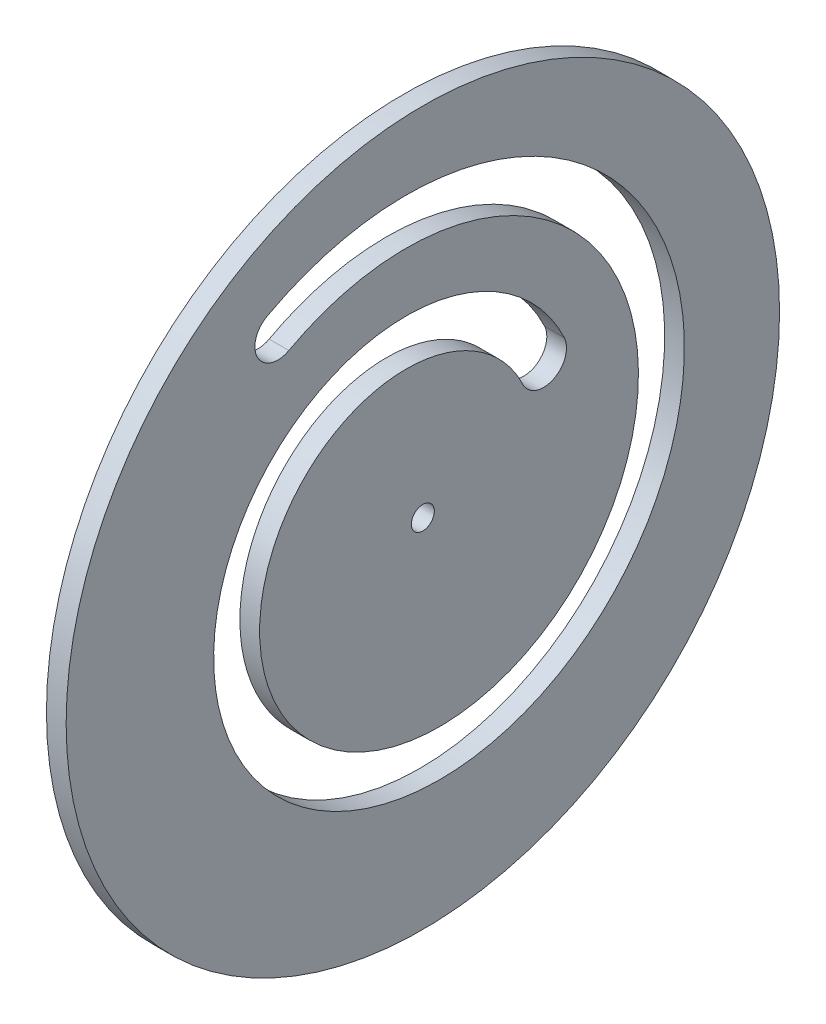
ISO-10303-21;
HEADER;
FILE_DESCRIPTION(('STEP AP214'),'2;1');
FILE_NAME('part.step','',(''),(''),'','','');
FILE_SCHEMA(('AUTOMOTIVE_DESIGN { 1 0 10303 214 1 1 1 1 }'));
ENDSEC;
DATA;
#1=APPLICATION_CONTEXT('core data for automotive mechanical design processes');
#2=APPLICATION_PROTOCOL_DEFINITION('international standard','automotive_design',2000,#1);
#3=PRODUCT_CONTEXT('',#1,'mechanical');
#4=PRODUCT('Part','Part','',(#3));
#5=PRODUCT_RELATED_PRODUCT_CATEGORY('part','',(#4));
#6=PRODUCT_DEFINITION_FORMATION('','',#4);
#7=PRODUCT_DEFINITION_CONTEXT('part definition',#1,'design');
#8=PRODUCT_DEFINITION('design','',#6,#7);
#9=PRODUCT_DEFINITION_SHAPE('','',#8);
#10=(LENGTH_UNIT() NAMED_UNIT(*) SI_UNIT(.MILLI.,.METRE.));
#11=(NAMED_UNIT(*) PLANE_ANGLE_UNIT() SI_UNIT($,.RADIAN.));
#12=(NAMED_UNIT(*) SI_UNIT($,.STERADIAN.) SOLID_ANGLE_UNIT());
#13=UNCERTAINTY_MEASURE_WITH_UNIT(LENGTH_MEASURE(1.E-05),#10,'distance_accuracy_value','');
#14=(GEOMETRIC_REPRESENTATION_CONTEXT(3) GLOBAL_UNCERTAINTY_ASSIGNED_CONTEXT((#13)) GLOBAL_UNIT_ASSIGNED_CONTEXT((#10,
#11,#12)) REPRESENTATION_CONTEXT('',''));
#15=CARTESIAN_POINT('',(0.,0.,0.));
#16=DIRECTION('',(0.,0.,1.));
#17=DIRECTION('',(1.,0.,0.));
#18=AXIS2_PLACEMENT_3D('',#15,#16,#17);
#19=CARTESIAN_POINT('',(3.,0.,0.));
#20=DIRECTION('',(-1.,0.,0.));
#21=DIRECTION('',(0.,0.,1.));
#22=AXIS2_PLACEMENT_3D('',#19,#20,#21);
#23=PLANE('',#22);
#24=CARTESIAN_POINT('',(3.,0.,0.));
#25=DIRECTION('',(1.,0.,0.));
#26=DIRECTION('',(0.,0.,-1.));
#27=AXIS2_PLACEMENT_3D('',#24,#25,#26);
#28=CIRCLE('',#27,1.75);
#29=CARTESIAN_POINT('',(3.,0.,-1.75));
#30=VERTEX_POINT('',#29);
#31=EDGE_CURVE('E235',#30,#30,#28,.T.);
#32=ORIENTED_EDGE('',*,*,#31,.F.);
#33=EDGE_LOOP('',(#32));
#34=FACE_BOUND('',#33,.T.);
#35=CARTESIAN_POINT('',(3.,0.,0.));
#36=DIRECTION('',(-1.,0.,0.));
#37=DIRECTION('',(0.,0.,1.));
#38=AXIS2_PLACEMENT_3D('',#35,#36,#37);
#39=CIRCLE('',#38,54.3426823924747);
#40=CARTESIAN_POINT('',(3.,0.,54.3426823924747));
#41=VERTEX_POINT('',#40);
#42=EDGE_CURVE('E11',#41,#41,#39,.T.);
#43=ORIENTED_EDGE('',*,*,#42,.F.);
#44=EDGE_LOOP('',(#43));
#45=FACE_BOUND('',#44,.T.);
#46=CARTESIAN_POINT('',(3.,32.2695191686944,20.4159245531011));
#47=CARTESIAN_POINT('',(3.,33.7619351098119,17.6676561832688));
#48=CARTESIAN_POINT('',(3.,34.9032776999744,14.7536064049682));
#49=CARTESIAN_POINT('',(3.,36.4320805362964,8.79416437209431));
#50=CARTESIAN_POINT('',(3.,36.8216953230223,5.7407079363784));
#51=CARTESIAN_POINT('',(3.,36.8502960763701,-0.309501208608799));
#52=CARTESIAN_POINT('',(3.,36.4894216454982,-3.31467857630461));
#53=CARTESIAN_POINT('',(3.,35.0657424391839,-9.08993148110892));
#54=CARTESIAN_POINT('',(3.,34.0010149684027,-11.8682233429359));
#55=CARTESIAN_POINT('',(3.,31.2592870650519,-17.0314388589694));
#56=CARTESIAN_POINT('',(3.,29.5784115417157,-19.4238727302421));
#57=CARTESIAN_POINT('',(3.,25.7281946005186,-23.686272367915));
#58=CARTESIAN_POINT('',(3.,23.55325401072,-25.5625854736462));
#59=CARTESIAN_POINT('',(3.,18.8641602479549,-28.6997612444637));
#60=CARTESIAN_POINT('',(3.,16.3430171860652,-29.9654203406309));
#61=CARTESIAN_POINT('',(3.,11.1262190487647,-31.8289212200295));
#62=CARTESIAN_POINT('',(3.,8.42260203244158,-32.4297129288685));
#63=CARTESIAN_POINT('',(3.,3.01037185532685,-32.953567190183));
#64=CARTESIAN_POINT('',(3.,0.293303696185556,-32.8775482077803));
#65=CARTESIAN_POINT('',(3.,-4.98207956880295,-32.0794731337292));
#66=CARTESIAN_POINT('',(3.,-7.54883211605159,-31.3562413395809));
#67=CARTESIAN_POINT('',(3.,-12.3754739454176,-29.3336324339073));
#68=CARTESIAN_POINT('',(3.,-14.6432716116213,-28.0310492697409));
#69=CARTESIAN_POINT('',(3.,-18.7480998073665,-24.952166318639));
#70=CARTESIAN_POINT('',(3.,-20.5920281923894,-23.1708171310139));
#71=CARTESIAN_POINT('',(3.,-23.7561876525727,-19.2618740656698));
#72=CARTESIAN_POINT('',(3.,-25.0818838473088,-17.1276868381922));
#73=CARTESIAN_POINT('',(3.,-27.1522236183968,-12.6567888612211));
#74=CARTESIAN_POINT('',(3.,-27.9005624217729,-10.3123349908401));
#75=CARTESIAN_POINT('',(3.,-28.7966241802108,-5.57137621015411));
#76=CARTESIAN_POINT('',(3.,-28.9460411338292,-3.16644394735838));
#77=CARTESIAN_POINT('',(3.,-28.6622615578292,1.54782721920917));
#78=CARTESIAN_POINT('',(3.,-28.2286467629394,3.86576863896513));
#79=CARTESIAN_POINT('',(3.,-26.8317989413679,8.27029471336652));
#80=CARTESIAN_POINT('',(3.,-25.8660519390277,10.3651350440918));
#81=CARTESIAN_POINT('',(3.,-23.4882527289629,14.2075479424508));
#82=CARTESIAN_POINT('',(3.,-22.0717346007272,15.962525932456));
#83=CARTESIAN_POINT('',(3.,-18.8996166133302,19.0355774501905));
#84=CARTESIAN_POINT('',(3.,-17.1378618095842,20.3597518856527));
#85=CARTESIAN_POINT('',(3.,-13.3987338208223,22.5123526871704));
#86=CARTESIAN_POINT('',(3.,-11.413883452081,23.3451980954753));
#87=CARTESIAN_POINT('',(3.,-7.35986828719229,24.4894862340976));
#88=CARTESIAN_POINT('',(3.,-5.28235307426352,24.8033889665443));
#89=CARTESIAN_POINT('',(3.,-1.17358840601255,24.9175232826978));
#90=CARTESIAN_POINT('',(3.,0.866380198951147,24.7180961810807));
#91=CARTESIAN_POINT('',(3.,4.77836946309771,23.8447553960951));
#92=CARTESIAN_POINT('',(3.,6.65894824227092,23.1690325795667));
#93=CARTESIAN_POINT('',(3.,10.146646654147,21.4098786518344));
#94=CARTESIAN_POINT('',(3.,11.7616402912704,20.3225867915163));
#95=CARTESIAN_POINT('',(3.,14.6347649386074,17.8292032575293));
#96=CARTESIAN_POINT('',(3.,15.8996011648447,16.417423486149));
#97=CARTESIAN_POINT('',(3.,18.015382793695,13.3794503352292));
#98=CARTESIAN_POINT('',(3.,18.8714479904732,11.7460784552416));
#99=CARTESIAN_POINT('',(3.,20.1414208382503,8.37742196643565));
#100=CARTESIAN_POINT('',(3.,20.5585399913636,6.63389843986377));
#101=CARTESIAN_POINT('',(3.,20.9515389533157,3.15798859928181));
#102=CARTESIAN_POINT('',(3.,20.9285131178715,1.41680058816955));
#103=CARTESIAN_POINT('',(3.,20.4698366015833,-1.94810417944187));
#104=CARTESIAN_POINT('',(3.,20.033081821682,-3.58064977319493));
#105=CARTESIAN_POINT('',(3.,18.8000326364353,-6.63515062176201));
#106=CARTESIAN_POINT('',(3.,18.0004878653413,-8.06542038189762));
#107=CARTESIAN_POINT('',(3.,16.1147360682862,-10.640800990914));
#108=CARTESIAN_POINT('',(3.,15.0233160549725,-11.7931974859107));
#109=CARTESIAN_POINT('',(3.,12.6407220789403,-13.760679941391));
#110=CARTESIAN_POINT('',(3.,11.3426776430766,-14.5815665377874));
#111=CARTESIAN_POINT('',(3.,9.99201850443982,-15.2200311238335));
#112=B_SPLINE_CURVE_WITH_KNOTS('',3,(#46,#47,#48,#49,#50,#51,#52,#53,#54,#55,#56,#57,#58,#59,
#60,#61,#62,#63,#64,#65,#66,#67,#68,#69,#70,#71,#72,#73,#74,#75,#76,#77,#78,#79,#80,#81,#82,#83,
#84,#85,#86,#87,#88,#89,#90,#91,#92,#93,#94,#95,#96,#97,#98,#99,#100,#101,#102,#103,#104,#105,
#106,#107,#108,#109,#110,#111),.UNSPECIFIED.,.F.,.F.,(4,2,2,2,2,2,2,2,2,2,2,2,2,2,2,2,2,2,2,2,2,
2,2,2,2,2,2,2,2,2,2,2,4),(0.,0.03125,0.0625,0.09375,0.125,0.15625,0.1875,0.21875,0.25,0.28125,
0.3125,0.34375,0.375,0.40625,0.4375,0.46875,0.5,0.53125,0.5625,0.59375,0.625,0.65625,0.6875,
0.71875,0.75,0.78125,0.8125,0.84375,0.875,0.90625,0.9375,0.96875,1.),.UNSPECIFIED.);
#113=CARTESIAN_POINT('',(3.,9.99201850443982,-15.2200311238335));
#114=VERTEX_POINT('',#113);
#115=CARTESIAN_POINT('',(3.,32.2695191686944,20.4159245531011));
#116=VERTEX_POINT('',#115);
#117=EDGE_CURVE('E44',#114,#116,#112,.F.);
#118=ORIENTED_EDGE('',*,*,#117,.T.);
#119=CARTESIAN_POINT('',(3.,35.3452720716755,22.0861772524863));
#120=DIRECTION('',(-1.,0.,0.));
#121=DIRECTION('',(0.,0.,-1.));
#122=AXIS2_PLACEMENT_3D('',#119,#120,#121);
#123=CIRCLE('',#122,3.5);
#124=CARTESIAN_POINT('',(3.,38.4210249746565,23.7564299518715));
#125=VERTEX_POINT('',#124);
#126=EDGE_CURVE('E73',#116,#125,#123,.T.);
#127=ORIENTED_EDGE('',*,*,#126,.T.);
#128=CARTESIAN_POINT('',(3.,12.9835654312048,-21.5485891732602));
#129=CARTESIAN_POINT('',(3.,14.8618316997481,-20.6607215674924));
#130=CARTESIAN_POINT('',(3.,16.6482304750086,-19.529556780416));
#131=CARTESIAN_POINT('',(3.,19.9301351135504,-16.8194476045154));
#132=CARTESIAN_POINT('',(3.,21.4182843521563,-15.2464466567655));
#133=CARTESIAN_POINT('',(3.,23.9925898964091,-11.7307047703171));
#134=CARTESIAN_POINT('',(3.,25.0730901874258,-9.79551682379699));
#135=CARTESIAN_POINT('',(3.,26.7421465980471,-5.66094191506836));
#136=CARTESIAN_POINT('',(3.,27.3270842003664,-3.47024830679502));
#137=CARTESIAN_POINT('',(3.,27.942983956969,1.04806460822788));
#138=CARTESIAN_POINT('',(3.,27.9725765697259,3.36638580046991));
#139=CARTESIAN_POINT('',(3.,27.4488675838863,7.99837059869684));
#140=CARTESIAN_POINT('',(3.,26.8965195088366,10.3027007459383));
#141=CARTESIAN_POINT('',(3.,25.2163376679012,14.7594538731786));
#142=CARTESIAN_POINT('',(3.,24.0917134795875,16.9030768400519));
#143=CARTESIAN_POINT('',(3.,21.3116710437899,20.8948376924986));
#144=CARTESIAN_POINT('',(3.,19.6615150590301,22.7352429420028));
#145=CARTESIAN_POINT('',(3.,15.9109396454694,25.9901045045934));
#146=CARTESIAN_POINT('',(3.,13.8175083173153,27.3983626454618));
#147=CARTESIAN_POINT('',(3.,9.29292035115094,29.6805114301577));
#148=CARTESIAN_POINT('',(3.,6.87004754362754,30.5501107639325));
#149=CARTESIAN_POINT('',(3.,1.82507340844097,31.6763872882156));
#150=CARTESIAN_POINT('',(3.,-0.787955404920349,31.9309356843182));
#151=CARTESIAN_POINT('',(3.,-6.05673170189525,31.7845782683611));
#152=CARTESIAN_POINT('',(3.,-8.70317113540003,31.3838301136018));
#153=CARTESIAN_POINT('',(3.,-13.8736333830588,29.9244131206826));
#154=CARTESIAN_POINT('',(3.,-16.3886783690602,28.8681735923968));
#155=CARTESIAN_POINT('',(3.,-21.1328578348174,26.1369687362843));
#156=CARTESIAN_POINT('',(3.,-23.3538889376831,24.4665521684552));
#157=CARTESIAN_POINT('',(3.,-27.3586970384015,20.5868157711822));
#158=CARTESIAN_POINT('',(3.,-29.1357350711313,18.3838841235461));
#159=CARTESIAN_POINT('',(3.,-32.1234425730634,13.5558878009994));
#160=CARTESIAN_POINT('',(3.,-33.3291437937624,10.9386601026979));
#161=CARTESIAN_POINT('',(3.,-35.0762769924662,5.42961780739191));
#162=CARTESIAN_POINT('',(3.,-35.6148098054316,2.54661158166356));
#163=CARTESIAN_POINT('',(3.,-35.968196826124,-3.32400908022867));
#164=CARTESIAN_POINT('',(3.,-35.7823936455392,-6.30237894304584));
#165=CARTESIAN_POINT('',(3.,-34.6712406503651,-12.1813604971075));
#166=CARTESIAN_POINT('',(3.,-33.7475121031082,-15.0728520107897));
#167=CARTESIAN_POINT('',(3.,-31.1906124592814,-20.5944758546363));
#168=CARTESIAN_POINT('',(3.,-29.5612403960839,-23.2161645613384));
#169=CARTESIAN_POINT('',(3.,-25.6687072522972,-28.0249267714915));
#170=CARTESIAN_POINT('',(3.,-23.4112906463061,-30.2047436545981));
#171=CARTESIAN_POINT('',(3.,-18.3805379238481,-33.9781290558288));
#172=CARTESIAN_POINT('',(3.,-15.6145421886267,-35.5660659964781));
#173=CARTESIAN_POINT('',(3.,-9.72060029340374,-38.0359280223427));
#174=CARTESIAN_POINT('',(3.,-6.60114492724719,-38.9141859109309));
#175=CARTESIAN_POINT('',(3.,-0.181762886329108,-39.88532839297));
#176=CARTESIAN_POINT('',(3.,3.10903704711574,-39.976730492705));
#177=CARTESIAN_POINT('',(3.,9.67270527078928,-39.3414275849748));
#178=CARTESIAN_POINT('',(3.,12.9363632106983,-38.6155129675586));
#179=CARTESIAN_POINT('',(3.,19.2423865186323,-36.3629282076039));
#180=CARTESIAN_POINT('',(3.,22.2760148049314,-34.8392722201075));
#181=CARTESIAN_POINT('',(3.,27.9262838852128,-31.0590348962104));
#182=CARTESIAN_POINT('',(3.,30.535188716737,-28.8075081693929));
#183=CARTESIAN_POINT('',(3.,35.1604814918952,-23.6870574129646));
#184=CARTESIAN_POINT('',(3.,37.1706016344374,-20.8249221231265));
#185=CARTESIAN_POINT('',(3.,40.4545410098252,-14.6406152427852));
#186=CARTESIAN_POINT('',(3.,41.7239387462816,-11.3265557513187));
#187=CARTESIAN_POINT('',(3.,43.4242974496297,-4.42893338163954));
#188=CARTESIAN_POINT('',(3.,43.852949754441,-0.854315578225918));
#189=CARTESIAN_POINT('',(3.,43.8188852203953,6.35170284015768));
#190=CARTESIAN_POINT('',(3.,43.3561114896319,9.97386579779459));
#191=CARTESIAN_POINT('',(3.,41.5401352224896,17.0527415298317));
#192=CARTESIAN_POINT('',(3.,40.1890979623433,20.5005420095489));
#193=CARTESIAN_POINT('',(3.,38.4210249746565,23.7564299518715));
#194=B_SPLINE_CURVE_WITH_KNOTS('',3,(#128,#129,#130,#131,#132,#133,#134,#135,#136,#137,#138,
#139,#140,#141,#142,#143,#144,#145,#146,#147,#148,#149,#150,#151,#152,#153,#154,#155,#156,#157,
#158,#159,#160,#161,#162,#163,#164,#165,#166,#167,#168,#169,#170,#171,#172,#173,#174,#175,#176,
#177,#178,#179,#180,#181,#182,#183,#184,#185,#186,#187,#188,#189,#190,#191,#192,#193),
.UNSPECIFIED.,.F.,.F.,(4,2,2,2,2,2,2,2,2,2,2,2,2,2,2,2,2,2,2,2,2,2,2,2,2,2,2,2,2,2,2,2,4),(0.,
0.03125,0.0625,0.09375,0.125,0.15625,0.1875,0.21875,0.25,0.28125,0.3125,0.34375,0.375,0.40625,
0.4375,0.46875,0.5,0.53125,0.5625,0.59375,0.625,0.65625,0.6875,0.71875,0.75,0.78125,0.8125,
0.84375,0.875,0.90625,0.9375,0.96875,1.),.UNSPECIFIED.);
#195=CARTESIAN_POINT('',(3.,12.9835654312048,-21.5485891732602));
#196=VERTEX_POINT('',#195);
#197=EDGE_CURVE('E82',#125,#196,#194,.F.);
#198=ORIENTED_EDGE('',*,*,#197,.T.);
#199=CARTESIAN_POINT('',(3.,11.4877919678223,-18.3843101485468));
#200=DIRECTION('',(-1.,0.,0.));
#201=DIRECTION('',(0.,0.,-1.));
#202=AXIS2_PLACEMENT_3D('',#199,#200,#201);
#203=CIRCLE('',#202,3.5);
#204=EDGE_CURVE('E91',#196,#114,#203,.T.);
#205=ORIENTED_EDGE('',*,*,#204,.T.);
#206=EDGE_LOOP('',(#118,#127,#198,#205));
#207=FACE_BOUND('',#206,.T.);
#208=ADVANCED_FACE('F27',(#34,#45,#207),#23,.F.);
#209=CARTESIAN_POINT('',(0.,0.,0.));
#210=DIRECTION('',(1.,0.,0.));
#211=DIRECTION('',(0.,0.,-1.));
#212=AXIS2_PLACEMENT_3D('',#209,#210,#211);
#213=PLANE('',#212);
#214=CARTESIAN_POINT('',(0.,0.,0.));
#215=DIRECTION('',(1.,0.,0.));
#216=DIRECTION('',(0.,0.,-1.));
#217=AXIS2_PLACEMENT_3D('',#214,#215,#216);
#218=CIRCLE('',#217,1.75);
#219=CARTESIAN_POINT('',(0.,0.,-1.75));
#220=VERTEX_POINT('',#219);
#221=EDGE_CURVE('E31',#220,#220,#218,.T.);
#222=ORIENTED_EDGE('',*,*,#221,.T.);
#223=EDGE_LOOP('',(#222));
#224=FACE_BOUND('',#223,.T.);
#225=CARTESIAN_POINT('',(0.,0.,0.));
#226=DIRECTION('',(-1.,0.,0.));
#227=DIRECTION('',(0.,0.,1.));
#228=AXIS2_PLACEMENT_3D('',#225,#226,#227);
#229=CIRCLE('',#228,54.3426823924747);
#230=CARTESIAN_POINT('',(0.,0.,54.3426823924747));
#231=VERTEX_POINT('',#230);
#232=EDGE_CURVE('E36',#231,#231,#229,.T.);
#233=ORIENTED_EDGE('',*,*,#232,.T.);
#234=EDGE_LOOP('',(#233));
#235=FACE_BOUND('',#234,.T.);
#236=CARTESIAN_POINT('',(0.,9.99201850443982,-15.2200311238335));
#237=CARTESIAN_POINT('',(0.,11.3426776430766,-14.5815665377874));
#238=CARTESIAN_POINT('',(0.,12.6407220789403,-13.760679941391));
#239=CARTESIAN_POINT('',(0.,15.0233160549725,-11.7931974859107));
#240=CARTESIAN_POINT('',(0.,16.1147360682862,-10.640800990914));
#241=CARTESIAN_POINT('',(0.,18.0004878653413,-8.06542038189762));
#242=CARTESIAN_POINT('',(0.,18.8000326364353,-6.63515062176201));
#243=CARTESIAN_POINT('',(0.,20.033081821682,-3.58064977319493));
#244=CARTESIAN_POINT('',(0.,20.4698366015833,-1.94810417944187));
#245=CARTESIAN_POINT('',(0.,20.9285131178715,1.41680058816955));
#246=CARTESIAN_POINT('',(0.,20.9515389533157,3.15798859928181));
#247=CARTESIAN_POINT('',(0.,20.5585399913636,6.63389843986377));
#248=CARTESIAN_POINT('',(0.,20.1414208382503,8.37742196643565));
#249=CARTESIAN_POINT('',(0.,18.8714479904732,11.7460784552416));
#250=CARTESIAN_POINT('',(0.,18.015382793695,13.3794503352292));
#251=CARTESIAN_POINT('',(0.,15.8996011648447,16.417423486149));
#252=CARTESIAN_POINT('',(0.,14.6347649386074,17.8292032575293));
#253=CARTESIAN_POINT('',(0.,11.7616402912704,20.3225867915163));
#254=CARTESIAN_POINT('',(0.,10.146646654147,21.4098786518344));
#255=CARTESIAN_POINT('',(0.,6.65894824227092,23.1690325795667));
#256=CARTESIAN_POINT('',(0.,4.77836946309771,23.8447553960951));
#257=CARTESIAN_POINT('',(0.,0.866380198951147,24.7180961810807));
#258=CARTESIAN_POINT('',(0.,-1.17358840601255,24.9175232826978));
#259=CARTESIAN_POINT('',(0.,-5.28235307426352,24.8033889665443));
#260=CARTESIAN_POINT('',(0.,-7.35986828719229,24.4894862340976));
#261=CARTESIAN_POINT('',(0.,-11.413883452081,23.3451980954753));
#262=CARTESIAN_POINT('',(0.,-13.3987338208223,22.5123526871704));
#263=CARTESIAN_POINT('',(0.,-17.1378618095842,20.3597518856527));
#264=CARTESIAN_POINT('',(0.,-18.8996166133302,19.0355774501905));
#265=CARTESIAN_POINT('',(0.,-22.0717346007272,15.962525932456));
#266=CARTESIAN_POINT('',(0.,-23.4882527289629,14.2075479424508));
#267=CARTESIAN_POINT('',(0.,-25.8660519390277,10.3651350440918));
#268=CARTESIAN_POINT('',(0.,-26.8317989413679,8.27029471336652));
#269=CARTESIAN_POINT('',(0.,-28.2286467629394,3.86576863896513));
#270=CARTESIAN_POINT('',(0.,-28.6622615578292,1.54782721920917));
#271=CARTESIAN_POINT('',(0.,-28.9460411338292,-3.16644394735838));
#272=CARTESIAN_POINT('',(0.,-28.7966241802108,-5.57137621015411));
#273=CARTESIAN_POINT('',(0.,-27.9005624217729,-10.3123349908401));
#274=CARTESIAN_POINT('',(0.,-27.1522236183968,-12.6567888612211));
#275=CARTESIAN_POINT('',(0.,-25.0818838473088,-17.1276868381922));
#276=CARTESIAN_POINT('',(0.,-23.7561876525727,-19.2618740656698));
#277=CARTESIAN_POINT('',(0.,-20.5920281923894,-23.1708171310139));
#278=CARTESIAN_POINT('',(0.,-18.7480998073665,-24.952166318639));
#279=CARTESIAN_POINT('',(0.,-14.6432716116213,-28.0310492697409));
#280=CARTESIAN_POINT('',(0.,-12.3754739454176,-29.3336324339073));
#281=CARTESIAN_POINT('',(0.,-7.54883211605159,-31.3562413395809));
#282=CARTESIAN_POINT('',(0.,-4.98207956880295,-32.0794731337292));
#283=CARTESIAN_POINT('',(0.,0.293303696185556,-32.8775482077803));
#284=CARTESIAN_POINT('',(0.,3.01037185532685,-32.953567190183));
#285=CARTESIAN_POINT('',(0.,8.42260203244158,-32.4297129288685));
#286=CARTESIAN_POINT('',(0.,11.1262190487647,-31.8289212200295));
#287=CARTESIAN_POINT('',(0.,16.3430171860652,-29.9654203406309));
#288=CARTESIAN_POINT('',(0.,18.8641602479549,-28.6997612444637));
#289=CARTESIAN_POINT('',(0.,23.55325401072,-25.5625854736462));
#290=CARTESIAN_POINT('',(0.,25.7281946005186,-23.686272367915));
#291=CARTESIAN_POINT('',(0.,29.5784115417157,-19.4238727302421));
#292=CARTESIAN_POINT('',(0.,31.2592870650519,-17.0314388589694));
#293=CARTESIAN_POINT('',(0.,34.0010149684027,-11.8682233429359));
#294=CARTESIAN_POINT('',(0.,35.0657424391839,-9.08993148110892));
#295=CARTESIAN_POINT('',(0.,36.4894216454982,-3.31467857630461));
#296=CARTESIAN_POINT('',(0.,36.8502960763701,-0.309501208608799));
#297=CARTESIAN_POINT('',(0.,36.8216953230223,5.7407079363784));
#298=CARTESIAN_POINT('',(0.,36.4320805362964,8.79416437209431));
#299=CARTESIAN_POINT('',(0.,34.9032776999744,14.7536064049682));
#300=CARTESIAN_POINT('',(0.,33.7619351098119,17.6676561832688));
#301=CARTESIAN_POINT('',(0.,32.2695191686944,20.4159245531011));
#302=B_SPLINE_CURVE_WITH_KNOTS('',3,(#236,#237,#238,#239,#240,#241,#242,#243,#244,#245,#246,
#247,#248,#249,#250,#251,#252,#253,#254,#255,#256,#257,#258,#259,#260,#261,#262,#263,#264,#265,
#266,#267,#268,#269,#270,#271,#272,#273,#274,#275,#276,#277,#278,#279,#280,#281,#282,#283,#284,
#285,#286,#287,#288,#289,#290,#291,#292,#293,#294,#295,#296,#297,#298,#299,#300,#301),
.UNSPECIFIED.,.F.,.F.,(4,2,2,2,2,2,2,2,2,2,2,2,2,2,2,2,2,2,2,2,2,2,2,2,2,2,2,2,2,2,2,2,4),(0.,
0.03125,0.0625,0.09375,0.125,0.15625,0.1875,0.21875,0.25,0.28125,0.3125,0.34375,0.375,0.40625,
0.4375,0.46875,0.5,0.53125,0.5625,0.59375,0.625,0.65625,0.6875,0.71875,0.75,0.78125,0.8125,
0.84375,0.875,0.90625,0.9375,0.96875,1.),.UNSPECIFIED.);
#303=CARTESIAN_POINT('',(0.,9.99201850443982,-15.2200311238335));
#304=VERTEX_POINT('',#303);
#305=CARTESIAN_POINT('',(0.,32.2695191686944,20.4159245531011));
#306=VERTEX_POINT('',#305);
#307=EDGE_CURVE('E86',#304,#306,#302,.T.);
#308=ORIENTED_EDGE('',*,*,#307,.F.);
#309=CARTESIAN_POINT('',(0.,11.4877919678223,-18.3843101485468));
#310=DIRECTION('',(-1.,0.,0.));
#311=DIRECTION('',(0.,0.,-1.));
#312=AXIS2_PLACEMENT_3D('',#309,#310,#311);
#313=CIRCLE('',#312,3.5);
#314=CARTESIAN_POINT('',(0.,12.9835654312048,-21.5485891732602));
#315=VERTEX_POINT('',#314);
#316=EDGE_CURVE('E158',#315,#304,#313,.T.);
#317=ORIENTED_EDGE('',*,*,#316,.F.);
#318=CARTESIAN_POINT('',(0.,38.4210249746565,23.7564299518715));
#319=CARTESIAN_POINT('',(0.,40.1890979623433,20.5005420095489));
#320=CARTESIAN_POINT('',(0.,41.5401352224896,17.0527415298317));
#321=CARTESIAN_POINT('',(0.,43.3561114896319,9.97386579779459));
#322=CARTESIAN_POINT('',(0.,43.8188852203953,6.35170284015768));
#323=CARTESIAN_POINT('',(0.,43.852949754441,-0.854315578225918));
#324=CARTESIAN_POINT('',(0.,43.4242974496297,-4.42893338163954));
#325=CARTESIAN_POINT('',(0.,41.7239387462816,-11.3265557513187));
#326=CARTESIAN_POINT('',(0.,40.4545410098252,-14.6406152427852));
#327=CARTESIAN_POINT('',(0.,37.1706016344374,-20.8249221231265));
#328=CARTESIAN_POINT('',(0.,35.1604814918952,-23.6870574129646));
#329=CARTESIAN_POINT('',(0.,30.535188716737,-28.8075081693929));
#330=CARTESIAN_POINT('',(0.,27.9262838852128,-31.0590348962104));
#331=CARTESIAN_POINT('',(0.,22.2760148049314,-34.8392722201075));
#332=CARTESIAN_POINT('',(0.,19.2423865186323,-36.3629282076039));
#333=CARTESIAN_POINT('',(0.,12.9363632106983,-38.6155129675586));
#334=CARTESIAN_POINT('',(0.,9.67270527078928,-39.3414275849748));
#335=CARTESIAN_POINT('',(0.,3.10903704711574,-39.976730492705));
#336=CARTESIAN_POINT('',(0.,-0.181762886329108,-39.88532839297));
#337=CARTESIAN_POINT('',(0.,-6.60114492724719,-38.9141859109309));
#338=CARTESIAN_POINT('',(0.,-9.72060029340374,-38.0359280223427));
#339=CARTESIAN_POINT('',(0.,-15.6145421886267,-35.5660659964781));
#340=CARTESIAN_POINT('',(0.,-18.3805379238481,-33.9781290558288));
#341=CARTESIAN_POINT('',(0.,-23.4112906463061,-30.2047436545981));
#342=CARTESIAN_POINT('',(0.,-25.6687072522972,-28.0249267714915));
#343=CARTESIAN_POINT('',(0.,-29.5612403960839,-23.2161645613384));
#344=CARTESIAN_POINT('',(0.,-31.1906124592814,-20.5944758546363));
#345=CARTESIAN_POINT('',(0.,-33.7475121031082,-15.0728520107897));
#346=CARTESIAN_POINT('',(0.,-34.6712406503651,-12.1813604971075));
#347=CARTESIAN_POINT('',(0.,-35.7823936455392,-6.30237894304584));
#348=CARTESIAN_POINT('',(0.,-35.968196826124,-3.32400908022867));
#349=CARTESIAN_POINT('',(0.,-35.6148098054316,2.54661158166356));
#350=CARTESIAN_POINT('',(0.,-35.0762769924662,5.42961780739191));
#351=CARTESIAN_POINT('',(0.,-33.3291437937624,10.9386601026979));
#352=CARTESIAN_POINT('',(0.,-32.1234425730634,13.5558878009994));
#353=CARTESIAN_POINT('',(0.,-29.1357350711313,18.3838841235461));
#354=CARTESIAN_POINT('',(0.,-27.3586970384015,20.5868157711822));
#355=CARTESIAN_POINT('',(0.,-23.3538889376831,24.4665521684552));
#356=CARTESIAN_POINT('',(0.,-21.1328578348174,26.1369687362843));
#357=CARTESIAN_POINT('',(0.,-16.3886783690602,28.8681735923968));
#358=CARTESIAN_POINT('',(0.,-13.8736333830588,29.9244131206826));
#359=CARTESIAN_POINT('',(0.,-8.70317113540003,31.3838301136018));
#360=CARTESIAN_POINT('',(0.,-6.05673170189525,31.7845782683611));
#361=CARTESIAN_POINT('',(0.,-0.787955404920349,31.9309356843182));
#362=CARTESIAN_POINT('',(0.,1.82507340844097,31.6763872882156));
#363=CARTESIAN_POINT('',(0.,6.87004754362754,30.5501107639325));
#364=CARTESIAN_POINT('',(0.,9.29292035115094,29.6805114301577));
#365=CARTESIAN_POINT('',(0.,13.8175083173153,27.3983626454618));
#366=CARTESIAN_POINT('',(0.,15.9109396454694,25.9901045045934));
#367=CARTESIAN_POINT('',(0.,19.6615150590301,22.7352429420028));
#368=CARTESIAN_POINT('',(0.,21.3116710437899,20.8948376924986));
#369=CARTESIAN_POINT('',(0.,24.0917134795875,16.9030768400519));
#370=CARTESIAN_POINT('',(0.,25.2163376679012,14.7594538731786));
#371=CARTESIAN_POINT('',(0.,26.8965195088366,10.3027007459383));
#372=CARTESIAN_POINT('',(0.,27.4488675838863,7.99837059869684));
#373=CARTESIAN_POINT('',(0.,27.9725765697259,3.36638580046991));
#374=CARTESIAN_POINT('',(0.,27.942983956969,1.04806460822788));
#375=CARTESIAN_POINT('',(0.,27.3270842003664,-3.47024830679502));
#376=CARTESIAN_POINT('',(0.,26.7421465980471,-5.66094191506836));
#377=CARTESIAN_POINT('',(0.,25.0730901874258,-9.79551682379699));
#378=CARTESIAN_POINT('',(0.,23.9925898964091,-11.7307047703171));
#379=CARTESIAN_POINT('',(0.,21.4182843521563,-15.2464466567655));
#380=CARTESIAN_POINT('',(0.,19.9301351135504,-16.8194476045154));
#381=CARTESIAN_POINT('',(0.,16.6482304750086,-19.529556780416));
#382=CARTESIAN_POINT('',(0.,14.8618316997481,-20.6607215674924));
#383=CARTESIAN_POINT('',(0.,12.9835654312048,-21.5485891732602));
#384=B_SPLINE_CURVE_WITH_KNOTS('',3,(#318,#319,#320,#321,#322,#323,#324,#325,#326,#327,#328,
#329,#330,#331,#332,#333,#334,#335,#336,#337,#338,#339,#340,#341,#342,#343,#344,#345,#346,#347,
#348,#349,#350,#351,#352,#353,#354,#355,#356,#357,#358,#359,#360,#361,#362,#363,#364,#365,#366,
#367,#368,#369,#370,#371,#372,#373,#374,#375,#376,#377,#378,#379,#380,#381,#382,#383),
.UNSPECIFIED.,.F.,.F.,(4,2,2,2,2,2,2,2,2,2,2,2,2,2,2,2,2,2,2,2,2,2,2,2,2,2,2,2,2,2,2,2,4),(0.,
0.03125,0.0625,0.09375,0.125,0.15625,0.1875,0.21875,0.25,0.28125,0.3125,0.34375,0.375,0.40625,
0.4375,0.46875,0.5,0.53125,0.5625,0.59375,0.625,0.65625,0.6875,0.71875,0.75,0.78125,0.8125,
0.84375,0.875,0.90625,0.9375,0.96875,1.),.UNSPECIFIED.);
#385=CARTESIAN_POINT('',(0.,38.4210249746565,23.7564299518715));
#386=VERTEX_POINT('',#385);
#387=EDGE_CURVE('E140',#386,#315,#384,.T.);
#388=ORIENTED_EDGE('',*,*,#387,.F.);
#389=CARTESIAN_POINT('',(0.,35.3452720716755,22.0861772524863));
#390=DIRECTION('',(-1.,0.,0.));
#391=DIRECTION('',(0.,0.,-1.));
#392=AXIS2_PLACEMENT_3D('',#389,#390,#391);
#393=CIRCLE('',#392,3.5);
#394=EDGE_CURVE('E206',#306,#386,#393,.T.);
#395=ORIENTED_EDGE('',*,*,#394,.F.);
#396=EDGE_LOOP('',(#308,#317,#388,#395));
#397=FACE_BOUND('',#396,.T.);
#398=ADVANCED_FACE('F114',(#224,#235,#397),#213,.F.);
#399=CARTESIAN_POINT('',(0.,0.,0.));
#400=DIRECTION('',(-1.,0.,0.));
#401=DIRECTION('',(0.,0.,1.));
#402=AXIS2_PLACEMENT_3D('',#399,#400,#401);
#403=CYLINDRICAL_SURFACE('',#402,54.3426823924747);
#404=ORIENTED_EDGE('',*,*,#232,.F.);
#405=EDGE_LOOP('',(#404));
#406=FACE_BOUND('',#405,.T.);
#407=ORIENTED_EDGE('',*,*,#42,.T.);
#408=EDGE_LOOP('',(#407));
#409=FACE_BOUND('',#408,.T.);
#410=ADVANCED_FACE('F123',(#406,#409),#403,.T.);
#411=CARTESIAN_POINT('',(0.,9.99201850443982,-15.2200311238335));
#412=CARTESIAN_POINT('',(0.,11.3426776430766,-14.5815665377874));
#413=CARTESIAN_POINT('',(0.,12.6407220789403,-13.760679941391));
#414=CARTESIAN_POINT('',(0.,15.0233160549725,-11.7931974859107));
#415=CARTESIAN_POINT('',(0.,16.1147360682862,-10.640800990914));
#416=CARTESIAN_POINT('',(0.,18.0004878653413,-8.06542038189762));
#417=CARTESIAN_POINT('',(0.,18.8000326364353,-6.63515062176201));
#418=CARTESIAN_POINT('',(0.,20.033081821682,-3.58064977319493));
#419=CARTESIAN_POINT('',(0.,20.4698366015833,-1.94810417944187));
#420=CARTESIAN_POINT('',(0.,20.9285131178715,1.41680058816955));
#421=CARTESIAN_POINT('',(0.,20.9515389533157,3.15798859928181));
#422=CARTESIAN_POINT('',(0.,20.5585399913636,6.63389843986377));
#423=CARTESIAN_POINT('',(0.,20.1414208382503,8.37742196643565));
#424=CARTESIAN_POINT('',(0.,18.8714479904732,11.7460784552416));
#425=CARTESIAN_POINT('',(0.,18.015382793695,13.3794503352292));
#426=CARTESIAN_POINT('',(0.,15.8996011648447,16.417423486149));
#427=CARTESIAN_POINT('',(0.,14.6347649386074,17.8292032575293));
#428=CARTESIAN_POINT('',(0.,11.7616402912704,20.3225867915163));
#429=CARTESIAN_POINT('',(0.,10.146646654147,21.4098786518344));
#430=CARTESIAN_POINT('',(0.,6.65894824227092,23.1690325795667));
#431=CARTESIAN_POINT('',(0.,4.77836946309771,23.8447553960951));
#432=CARTESIAN_POINT('',(0.,0.866380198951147,24.7180961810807));
#433=CARTESIAN_POINT('',(0.,-1.17358840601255,24.9175232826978));
#434=CARTESIAN_POINT('',(0.,-5.28235307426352,24.8033889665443));
#435=CARTESIAN_POINT('',(0.,-7.35986828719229,24.4894862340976));
#436=CARTESIAN_POINT('',(0.,-11.413883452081,23.3451980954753));
#437=CARTESIAN_POINT('',(0.,-13.3987338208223,22.5123526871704));
#438=CARTESIAN_POINT('',(0.,-17.1378618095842,20.3597518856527));
#439=CARTESIAN_POINT('',(0.,-18.8996166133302,19.0355774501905));
#440=CARTESIAN_POINT('',(0.,-22.0717346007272,15.962525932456));
#441=CARTESIAN_POINT('',(0.,-23.4882527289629,14.2075479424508));
#442=CARTESIAN_POINT('',(0.,-25.8660519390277,10.3651350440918));
#443=CARTESIAN_POINT('',(0.,-26.8317989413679,8.27029471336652));
#444=CARTESIAN_POINT('',(0.,-28.2286467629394,3.86576863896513));
#445=CARTESIAN_POINT('',(0.,-28.6622615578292,1.54782721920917));
#446=CARTESIAN_POINT('',(0.,-28.9460411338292,-3.16644394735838));
#447=CARTESIAN_POINT('',(0.,-28.7966241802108,-5.57137621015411));
#448=CARTESIAN_POINT('',(0.,-27.9005624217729,-10.3123349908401));
#449=CARTESIAN_POINT('',(0.,-27.1522236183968,-12.6567888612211));
#450=CARTESIAN_POINT('',(0.,-25.0818838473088,-17.1276868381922));
#451=CARTESIAN_POINT('',(0.,-23.7561876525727,-19.2618740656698));
#452=CARTESIAN_POINT('',(0.,-20.5920281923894,-23.1708171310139));
#453=CARTESIAN_POINT('',(0.,-18.7480998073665,-24.952166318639));
#454=CARTESIAN_POINT('',(0.,-14.6432716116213,-28.0310492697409));
#455=CARTESIAN_POINT('',(0.,-12.3754739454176,-29.3336324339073));
#456=CARTESIAN_POINT('',(0.,-7.54883211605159,-31.3562413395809));
#457=CARTESIAN_POINT('',(0.,-4.98207956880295,-32.0794731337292));
#458=CARTESIAN_POINT('',(0.,0.293303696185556,-32.8775482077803));
#459=CARTESIAN_POINT('',(0.,3.01037185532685,-32.953567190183));
#460=CARTESIAN_POINT('',(0.,8.42260203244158,-32.4297129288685));
#461=CARTESIAN_POINT('',(0.,11.1262190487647,-31.8289212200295));
#462=CARTESIAN_POINT('',(0.,16.3430171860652,-29.9654203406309));
#463=CARTESIAN_POINT('',(0.,18.8641602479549,-28.6997612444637));
#464=CARTESIAN_POINT('',(0.,23.55325401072,-25.5625854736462));
#465=CARTESIAN_POINT('',(0.,25.7281946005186,-23.686272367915));
#466=CARTESIAN_POINT('',(0.,29.5784115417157,-19.4238727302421));
#467=CARTESIAN_POINT('',(0.,31.2592870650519,-17.0314388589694));
#468=CARTESIAN_POINT('',(0.,34.0010149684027,-11.8682233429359));
#469=CARTESIAN_POINT('',(0.,35.0657424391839,-9.08993148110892));
#470=CARTESIAN_POINT('',(0.,36.4894216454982,-3.31467857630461));
#471=CARTESIAN_POINT('',(0.,36.8502960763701,-0.309501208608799));
#472=CARTESIAN_POINT('',(0.,36.8216953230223,5.7407079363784));
#473=CARTESIAN_POINT('',(0.,36.4320805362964,8.79416437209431));
#474=CARTESIAN_POINT('',(0.,34.9032776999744,14.7536064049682));
#475=CARTESIAN_POINT('',(0.,33.7619351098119,17.6676561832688));
#476=CARTESIAN_POINT('',(0.,32.2695191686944,20.4159245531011));
#477=B_SPLINE_CURVE_WITH_KNOTS('',3,(#411,#412,#413,#414,#415,#416,#417,#418,#419,#420,#421,
#422,#423,#424,#425,#426,#427,#428,#429,#430,#431,#432,#433,#434,#435,#436,#437,#438,#439,#440,
#441,#442,#443,#444,#445,#446,#447,#448,#449,#450,#451,#452,#453,#454,#455,#456,#457,#458,#459,
#460,#461,#462,#463,#464,#465,#466,#467,#468,#469,#470,#471,#472,#473,#474,#475,#476),
.UNSPECIFIED.,.F.,.F.,(4,2,2,2,2,2,2,2,2,2,2,2,2,2,2,2,2,2,2,2,2,2,2,2,2,2,2,2,2,2,2,2,4),(0.,
0.03125,0.0625,0.09375,0.125,0.15625,0.1875,0.21875,0.25,0.28125,0.3125,0.34375,0.375,0.40625,
0.4375,0.46875,0.5,0.53125,0.5625,0.59375,0.625,0.65625,0.6875,0.71875,0.75,0.78125,0.8125,
0.84375,0.875,0.90625,0.9375,0.96875,1.),.UNSPECIFIED.);
#478=DIRECTION('',(1.,0.,0.));
#479=VECTOR('',#478,1.);
#480=SURFACE_OF_LINEAR_EXTRUSION('',#477,#479);
#481=ORIENTED_EDGE('',*,*,#117,.F.);
#482=DIRECTION('',(1.,0.,0.));
#483=VECTOR('',#482,1.);
#484=CARTESIAN_POINT('',(0.,9.99201850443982,-15.2200311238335));
#485=LINE('',#484,#483);
#486=EDGE_CURVE('E156',#304,#114,#485,.T.);
#487=ORIENTED_EDGE('',*,*,#486,.F.);
#488=ORIENTED_EDGE('',*,*,#307,.T.);
#489=DIRECTION('',(1.,0.,0.));
#490=VECTOR('',#489,1.);
#491=CARTESIAN_POINT('',(0.,32.2695191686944,20.4159245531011));
#492=LINE('',#491,#490);
#493=EDGE_CURVE('E75',#306,#116,#492,.T.);
#494=ORIENTED_EDGE('',*,*,#493,.T.);
#495=EDGE_LOOP('',(#481,#487,#488,#494));
#496=FACE_BOUND('',#495,.T.);
#497=ADVANCED_FACE('F84',(#496),#480,.T.);
#498=CARTESIAN_POINT('',(0.,35.3452720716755,22.0861772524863));
#499=DIRECTION('',(1.,0.,0.));
#500=DIRECTION('',(0.,0.,-1.));
#501=AXIS2_PLACEMENT_3D('',#498,#499,#500);
#502=CYLINDRICAL_SURFACE('',#501,3.5);
#503=ORIENTED_EDGE('',*,*,#126,.F.);
#504=ORIENTED_EDGE('',*,*,#493,.F.);
#505=ORIENTED_EDGE('',*,*,#394,.T.);
#506=DIRECTION('',(1.,0.,0.));
#507=VECTOR('',#506,1.);
#508=CARTESIAN_POINT('',(0.,38.4210249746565,23.7564299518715));
#509=LINE('',#508,#507);
#510=EDGE_CURVE('E78',#386,#125,#509,.T.);
#511=ORIENTED_EDGE('',*,*,#510,.T.);
#512=EDGE_LOOP('',(#503,#504,#505,#511));
#513=FACE_BOUND('',#512,.T.);
#514=ADVANCED_FACE('F74',(#513),#502,.F.);
#515=CARTESIAN_POINT('',(0.,38.4210249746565,23.7564299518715));
#516=CARTESIAN_POINT('',(0.,40.1890979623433,20.5005420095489));
#517=CARTESIAN_POINT('',(0.,41.5401352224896,17.0527415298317));
#518=CARTESIAN_POINT('',(0.,43.3561114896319,9.97386579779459));
#519=CARTESIAN_POINT('',(0.,43.8188852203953,6.35170284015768));
#520=CARTESIAN_POINT('',(0.,43.852949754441,-0.854315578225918));
#521=CARTESIAN_POINT('',(0.,43.4242974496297,-4.42893338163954));
#522=CARTESIAN_POINT('',(0.,41.7239387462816,-11.3265557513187));
#523=CARTESIAN_POINT('',(0.,40.4545410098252,-14.6406152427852));
#524=CARTESIAN_POINT('',(0.,37.1706016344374,-20.8249221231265));
#525=CARTESIAN_POINT('',(0.,35.1604814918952,-23.6870574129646));
#526=CARTESIAN_POINT('',(0.,30.535188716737,-28.8075081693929));
#527=CARTESIAN_POINT('',(0.,27.9262838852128,-31.0590348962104));
#528=CARTESIAN_POINT('',(0.,22.2760148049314,-34.8392722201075));
#529=CARTESIAN_POINT('',(0.,19.2423865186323,-36.3629282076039));
#530=CARTESIAN_POINT('',(0.,12.9363632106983,-38.6155129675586));
#531=CARTESIAN_POINT('',(0.,9.67270527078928,-39.3414275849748));
#532=CARTESIAN_POINT('',(0.,3.10903704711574,-39.976730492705));
#533=CARTESIAN_POINT('',(0.,-0.181762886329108,-39.88532839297));
#534=CARTESIAN_POINT('',(0.,-6.60114492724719,-38.9141859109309));
#535=CARTESIAN_POINT('',(0.,-9.72060029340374,-38.0359280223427));
#536=CARTESIAN_POINT('',(0.,-15.6145421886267,-35.5660659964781));
#537=CARTESIAN_POINT('',(0.,-18.3805379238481,-33.9781290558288));
#538=CARTESIAN_POINT('',(0.,-23.4112906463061,-30.2047436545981));
#539=CARTESIAN_POINT('',(0.,-25.6687072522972,-28.0249267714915));
#540=CARTESIAN_POINT('',(0.,-29.5612403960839,-23.2161645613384));
#541=CARTESIAN_POINT('',(0.,-31.1906124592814,-20.5944758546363));
#542=CARTESIAN_POINT('',(0.,-33.7475121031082,-15.0728520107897));
#543=CARTESIAN_POINT('',(0.,-34.6712406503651,-12.1813604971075));
#544=CARTESIAN_POINT('',(0.,-35.7823936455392,-6.30237894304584));
#545=CARTESIAN_POINT('',(0.,-35.968196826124,-3.32400908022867));
#546=CARTESIAN_POINT('',(0.,-35.6148098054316,2.54661158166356));
#547=CARTESIAN_POINT('',(0.,-35.0762769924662,5.42961780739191));
#548=CARTESIAN_POINT('',(0.,-33.3291437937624,10.9386601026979));
#549=CARTESIAN_POINT('',(0.,-32.1234425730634,13.5558878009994));
#550=CARTESIAN_POINT('',(0.,-29.1357350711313,18.3838841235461));
#551=CARTESIAN_POINT('',(0.,-27.3586970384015,20.5868157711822));
#552=CARTESIAN_POINT('',(0.,-23.3538889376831,24.4665521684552));
#553=CARTESIAN_POINT('',(0.,-21.1328578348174,26.1369687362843));
#554=CARTESIAN_POINT('',(0.,-16.3886783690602,28.8681735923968));
#555=CARTESIAN_POINT('',(0.,-13.8736333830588,29.9244131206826));
#556=CARTESIAN_POINT('',(0.,-8.70317113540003,31.3838301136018));
#557=CARTESIAN_POINT('',(0.,-6.05673170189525,31.7845782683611));
#558=CARTESIAN_POINT('',(0.,-0.787955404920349,31.9309356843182));
#559=CARTESIAN_POINT('',(0.,1.82507340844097,31.6763872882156));
#560=CARTESIAN_POINT('',(0.,6.87004754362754,30.5501107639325));
#561=CARTESIAN_POINT('',(0.,9.29292035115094,29.6805114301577));
#562=CARTESIAN_POINT('',(0.,13.8175083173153,27.3983626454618));
#563=CARTESIAN_POINT('',(0.,15.9109396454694,25.9901045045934));
#564=CARTESIAN_POINT('',(0.,19.6615150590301,22.7352429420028));
#565=CARTESIAN_POINT('',(0.,21.3116710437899,20.8948376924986));
#566=CARTESIAN_POINT('',(0.,24.0917134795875,16.9030768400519));
#567=CARTESIAN_POINT('',(0.,25.2163376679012,14.7594538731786));
#568=CARTESIAN_POINT('',(0.,26.8965195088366,10.3027007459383));
#569=CARTESIAN_POINT('',(0.,27.4488675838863,7.99837059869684));
#570=CARTESIAN_POINT('',(0.,27.9725765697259,3.36638580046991));
#571=CARTESIAN_POINT('',(0.,27.942983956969,1.04806460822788));
#572=CARTESIAN_POINT('',(0.,27.3270842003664,-3.47024830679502));
#573=CARTESIAN_POINT('',(0.,26.7421465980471,-5.66094191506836));
#574=CARTESIAN_POINT('',(0.,25.0730901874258,-9.79551682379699));
#575=CARTESIAN_POINT('',(0.,23.9925898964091,-11.7307047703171));
#576=CARTESIAN_POINT('',(0.,21.4182843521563,-15.2464466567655));
#577=CARTESIAN_POINT('',(0.,19.9301351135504,-16.8194476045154));
#578=CARTESIAN_POINT('',(0.,16.6482304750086,-19.529556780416));
#579=CARTESIAN_POINT('',(0.,14.8618316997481,-20.6607215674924));
#580=CARTESIAN_POINT('',(0.,12.9835654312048,-21.5485891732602));
#581=B_SPLINE_CURVE_WITH_KNOTS('',3,(#515,#516,#517,#518,#519,#520,#521,#522,#523,#524,#525,
#526,#527,#528,#529,#530,#531,#532,#533,#534,#535,#536,#537,#538,#539,#540,#541,#542,#543,#544,
#545,#546,#547,#548,#549,#550,#551,#552,#553,#554,#555,#556,#557,#558,#559,#560,#561,#562,#563,
#564,#565,#566,#567,#568,#569,#570,#571,#572,#573,#574,#575,#576,#577,#578,#579,#580),
.UNSPECIFIED.,.F.,.F.,(4,2,2,2,2,2,2,2,2,2,2,2,2,2,2,2,2,2,2,2,2,2,2,2,2,2,2,2,2,2,2,2,4),(0.,
0.03125,0.0625,0.09375,0.125,0.15625,0.1875,0.21875,0.25,0.28125,0.3125,0.34375,0.375,0.40625,
0.4375,0.46875,0.5,0.53125,0.5625,0.59375,0.625,0.65625,0.6875,0.71875,0.75,0.78125,0.8125,
0.84375,0.875,0.90625,0.9375,0.96875,1.),.UNSPECIFIED.);
#582=DIRECTION('',(1.,0.,0.));
#583=VECTOR('',#582,1.);
#584=SURFACE_OF_LINEAR_EXTRUSION('',#581,#583);
#585=ORIENTED_EDGE('',*,*,#197,.F.);
#586=ORIENTED_EDGE('',*,*,#510,.F.);
#587=ORIENTED_EDGE('',*,*,#387,.T.);
#588=DIRECTION('',(1.,0.,0.));
#589=VECTOR('',#588,1.);
#590=CARTESIAN_POINT('',(0.,12.9835654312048,-21.5485891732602));
#591=LINE('',#590,#589);
#592=EDGE_CURVE('E53',#315,#196,#591,.T.);
#593=ORIENTED_EDGE('',*,*,#592,.T.);
#594=EDGE_LOOP('',(#585,#586,#587,#593));
#595=FACE_BOUND('',#594,.T.);
#596=ADVANCED_FACE('F177',(#595),#584,.T.);
#597=CARTESIAN_POINT('',(0.,11.4877919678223,-18.3843101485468));
#598=DIRECTION('',(1.,0.,0.));
#599=DIRECTION('',(0.,0.,-1.));
#600=AXIS2_PLACEMENT_3D('',#597,#598,#599);
#601=CYLINDRICAL_SURFACE('',#600,3.5);
#602=ORIENTED_EDGE('',*,*,#204,.F.);
#603=ORIENTED_EDGE('',*,*,#592,.F.);
#604=ORIENTED_EDGE('',*,*,#316,.T.);
#605=ORIENTED_EDGE('',*,*,#486,.T.);
#606=EDGE_LOOP('',(#602,#603,#604,#605));
#607=FACE_BOUND('',#606,.T.);
#608=ADVANCED_FACE('F187',(#607),#601,.F.);
#609=CARTESIAN_POINT('',(-0.01,0.,0.));
#610=DIRECTION('',(1.,0.,0.));
#611=DIRECTION('',(0.,0.,-1.));
#612=AXIS2_PLACEMENT_3D('',#609,#610,#611);
#613=CYLINDRICAL_SURFACE('',#612,1.75);
#614=ORIENTED_EDGE('',*,*,#31,.T.);
#615=EDGE_LOOP('',(#614));
#616=FACE_BOUND('',#615,.T.);
#617=ORIENTED_EDGE('',*,*,#221,.F.);
#618=EDGE_LOOP('',(#617));
#619=FACE_BOUND('',#618,.T.);
#620=ADVANCED_FACE('F223',(#616,#619),#613,.F.);
#621=CLOSED_SHELL('',(#208,#398,#410,#497,#514,#596,#608,#620));
#622=MANIFOLD_SOLID_BREP('B2',#621);
#623=ADVANCED_BREP_SHAPE_REPRESENTATION('',(#18,#622),#14);
#624=SHAPE_DEFINITION_REPRESENTATION(#9,#623);
ENDSEC;
END-ISO-10303-21;
